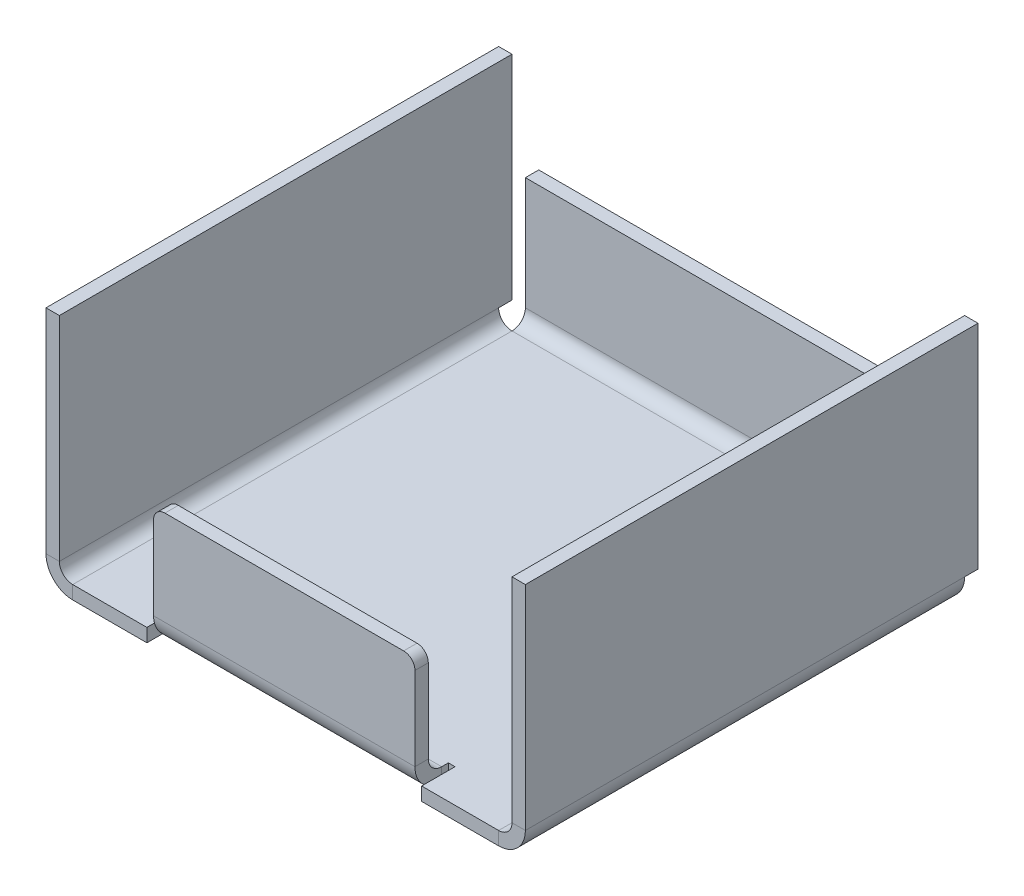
ISO-10303-21;
HEADER;
FILE_DESCRIPTION(('STEP AP214'),'2;1');
FILE_NAME('part.step','',(''),(''),'','','');
FILE_SCHEMA(('AUTOMOTIVE_DESIGN { 1 0 10303 214 1 1 1 1 }'));
ENDSEC;
DATA;
#1=APPLICATION_CONTEXT('core data for automotive mechanical design processes');
#2=APPLICATION_PROTOCOL_DEFINITION('international standard','automotive_design',2000,#1);
#3=PRODUCT_CONTEXT('',#1,'mechanical');
#4=PRODUCT('Part','Part','',(#3));
#5=PRODUCT_RELATED_PRODUCT_CATEGORY('part','',(#4));
#6=PRODUCT_DEFINITION_FORMATION('','',#4);
#7=PRODUCT_DEFINITION_CONTEXT('part definition',#1,'design');
#8=PRODUCT_DEFINITION('design','',#6,#7);
#9=PRODUCT_DEFINITION_SHAPE('','',#8);
#10=(LENGTH_UNIT() NAMED_UNIT(*) SI_UNIT(.MILLI.,.METRE.));
#11=(NAMED_UNIT(*) PLANE_ANGLE_UNIT() SI_UNIT($,.RADIAN.));
#12=(NAMED_UNIT(*) SI_UNIT($,.STERADIAN.) SOLID_ANGLE_UNIT());
#13=UNCERTAINTY_MEASURE_WITH_UNIT(LENGTH_MEASURE(1.E-05),#10,'distance_accuracy_value','');
#14=(GEOMETRIC_REPRESENTATION_CONTEXT(3) GLOBAL_UNCERTAINTY_ASSIGNED_CONTEXT((#13)) GLOBAL_UNIT_ASSIGNED_CONTEXT((#10,
#11,#12)) REPRESENTATION_CONTEXT('',''));
#15=CARTESIAN_POINT('',(0.,0.,0.));
#16=DIRECTION('',(0.,0.,1.));
#17=DIRECTION('',(1.,0.,0.));
#18=AXIS2_PLACEMENT_3D('',#15,#16,#17);
#19=CARTESIAN_POINT('',(-53.8,3.,-47.8));
#20=DIRECTION('',(0.,1.,0.));
#21=DIRECTION('',(-1.,0.,0.));
#22=AXIS2_PLACEMENT_3D('',#19,#20,#21);
#23=PLANE('',#22);
#24=DIRECTION('',(1.,0.,0.));
#25=VECTOR('',#24,1.);
#26=CARTESIAN_POINT('',(-53.8,3.,-47.8));
#27=LINE('',#26,#25);
#28=CARTESIAN_POINT('',(-53.8,3.,-47.8));
#29=VERTEX_POINT('',#28);
#30=CARTESIAN_POINT('',(-50.8,3.,-47.8));
#31=VERTEX_POINT('',#30);
#32=EDGE_CURVE('E13',#29,#31,#27,.T.);
#33=ORIENTED_EDGE('',*,*,#32,.F.);
#34=DIRECTION('',(0.,0.,-1.));
#35=VECTOR('',#34,1.);
#36=CARTESIAN_POINT('',(-53.8,3.,50.8));
#37=LINE('',#36,#35);
#38=CARTESIAN_POINT('',(-53.8,3.,-50.8));
#39=VERTEX_POINT('',#38);
#40=EDGE_CURVE('E502',#29,#39,#37,.T.);
#41=ORIENTED_EDGE('',*,*,#40,.T.);
#42=DIRECTION('',(-1.,0.,0.));
#43=VECTOR('',#42,1.);
#44=CARTESIAN_POINT('',(-50.8,3.,-50.8));
#45=LINE('',#44,#43);
#46=CARTESIAN_POINT('',(-50.8,3.,-50.8));
#47=VERTEX_POINT('',#46);
#48=EDGE_CURVE('E536',#47,#39,#45,.T.);
#49=ORIENTED_EDGE('',*,*,#48,.F.);
#50=DIRECTION('',(0.,0.,-1.));
#51=VECTOR('',#50,1.);
#52=CARTESIAN_POINT('',(-50.8,3.,50.8));
#53=LINE('',#52,#51);
#54=EDGE_CURVE('E510',#31,#47,#53,.T.);
#55=ORIENTED_EDGE('',*,*,#54,.F.);
#56=EDGE_LOOP('',(#33,#41,#49,#55));
#57=FACE_BOUND('',#56,.T.);
#58=ADVANCED_FACE('F65',(#57),#23,.F.);
#59=CARTESIAN_POINT('',(-47.8,3.,50.8));
#60=DIRECTION('',(0.,0.,-1.));
#61=DIRECTION('',(-1.,0.,0.));
#62=AXIS2_PLACEMENT_3D('',#59,#60,#61);
#63=CYLINDRICAL_SURFACE('',#62,3.);
#64=DIRECTION('',(0.,0.,-1.));
#65=VECTOR('',#64,1.);
#66=CARTESIAN_POINT('',(-47.8,0.,50.8));
#67=LINE('',#66,#65);
#68=CARTESIAN_POINT('',(-47.8,0.,50.8));
#69=VERTEX_POINT('',#68);
#70=CARTESIAN_POINT('',(-47.8,0.,-47.8));
#71=VERTEX_POINT('',#70);
#72=EDGE_CURVE('E514',#69,#71,#67,.T.);
#73=ORIENTED_EDGE('',*,*,#72,.T.);
#74=CARTESIAN_POINT('',(-47.8,3.,-47.8));
#75=DIRECTION('',(0.,0.,-1.));
#76=DIRECTION('',(0.,1.,0.));
#77=AXIS2_PLACEMENT_3D('',#74,#75,#76);
#78=CIRCLE('',#77,3.);
#79=EDGE_CURVE('E72',#71,#31,#78,.T.);
#80=ORIENTED_EDGE('',*,*,#79,.T.);
#81=CARTESIAN_POINT('',(-50.8,3.,50.8));
#82=VERTEX_POINT('',#81);
#83=EDGE_CURVE('E511',#82,#31,#53,.T.);
#84=ORIENTED_EDGE('',*,*,#83,.F.);
#85=CARTESIAN_POINT('',(-47.8,3.,50.8));
#86=DIRECTION('',(0.,0.,-1.));
#87=DIRECTION('',(-1.,0.,0.));
#88=AXIS2_PLACEMENT_3D('',#85,#86,#87);
#89=CIRCLE('',#88,3.);
#90=EDGE_CURVE('E455',#82,#69,#89,.F.);
#91=ORIENTED_EDGE('',*,*,#90,.T.);
#92=EDGE_LOOP('',(#73,#80,#84,#91));
#93=FACE_BOUND('',#92,.T.);
#94=ADVANCED_FACE('F570',(#93),#63,.F.);
#95=CARTESIAN_POINT('',(-47.8,3.,-47.8));
#96=DIRECTION('',(0.,0.,-1.));
#97=DIRECTION('',(0.,1.,0.));
#98=AXIS2_PLACEMENT_3D('',#95,#96,#97);
#99=PLANE('',#98);
#100=CARTESIAN_POINT('',(-47.8,3.,-47.8));
#101=DIRECTION('',(0.,0.,-1.));
#102=DIRECTION('',(0.,1.,0.));
#103=AXIS2_PLACEMENT_3D('',#100,#101,#102);
#104=CIRCLE('',#103,6.);
#105=CARTESIAN_POINT('',(-47.8,-3.00000000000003,-47.8));
#106=VERTEX_POINT('',#105);
#107=EDGE_CURVE('E567',#106,#29,#104,.T.);
#108=ORIENTED_EDGE('',*,*,#107,.T.);
#109=ORIENTED_EDGE('',*,*,#32,.T.);
#110=ORIENTED_EDGE('',*,*,#79,.F.);
#111=DIRECTION('',(0.,-1.,0.));
#112=VECTOR('',#111,1.);
#113=CARTESIAN_POINT('',(-47.8,0.,-47.8));
#114=LINE('',#113,#112);
#115=EDGE_CURVE('E324',#71,#106,#114,.T.);
#116=ORIENTED_EDGE('',*,*,#115,.T.);
#117=EDGE_LOOP('',(#108,#109,#110,#116));
#118=FACE_BOUND('',#117,.T.);
#119=ADVANCED_FACE('F667',(#118),#99,.T.);
#120=CARTESIAN_POINT('',(50.8,3.,-47.8));
#121=DIRECTION('',(0.,1.,0.));
#122=DIRECTION('',(0.,0.,1.));
#123=AXIS2_PLACEMENT_3D('',#120,#121,#122);
#124=PLANE('',#123);
#125=DIRECTION('',(1.,0.,0.));
#126=VECTOR('',#125,1.);
#127=CARTESIAN_POINT('',(50.8,3.,-47.8));
#128=LINE('',#127,#126);
#129=CARTESIAN_POINT('',(50.8,3.,-47.8));
#130=VERTEX_POINT('',#129);
#131=CARTESIAN_POINT('',(53.8,3.,-47.8));
#132=VERTEX_POINT('',#131);
#133=EDGE_CURVE('E565',#130,#132,#128,.T.);
#134=ORIENTED_EDGE('',*,*,#133,.F.);
#135=DIRECTION('',(0.,0.,-1.));
#136=VECTOR('',#135,1.);
#137=CARTESIAN_POINT('',(50.8,3.,50.8));
#138=LINE('',#137,#136);
#139=CARTESIAN_POINT('',(50.8,3.,-50.8));
#140=VERTEX_POINT('',#139);
#141=EDGE_CURVE('E520',#130,#140,#138,.T.);
#142=ORIENTED_EDGE('',*,*,#141,.T.);
#143=DIRECTION('',(-1.,0.,0.));
#144=VECTOR('',#143,1.);
#145=CARTESIAN_POINT('',(53.8,3.,-50.8));
#146=LINE('',#145,#144);
#147=CARTESIAN_POINT('',(53.8,3.,-50.8));
#148=VERTEX_POINT('',#147);
#149=EDGE_CURVE('E528',#148,#140,#146,.T.);
#150=ORIENTED_EDGE('',*,*,#149,.F.);
#151=DIRECTION('',(0.,0.,-1.));
#152=VECTOR('',#151,1.);
#153=CARTESIAN_POINT('',(53.8,3.,50.8));
#154=LINE('',#153,#152);
#155=EDGE_CURVE('E477',#132,#148,#154,.T.);
#156=ORIENTED_EDGE('',*,*,#155,.F.);
#157=EDGE_LOOP('',(#134,#142,#150,#156));
#158=FACE_BOUND('',#157,.T.);
#159=ADVANCED_FACE('F672',(#158),#124,.F.);
#160=CARTESIAN_POINT('',(47.8,3.,50.8));
#161=DIRECTION('',(0.,0.,-1.));
#162=DIRECTION('',(-1.,0.,0.));
#163=AXIS2_PLACEMENT_3D('',#160,#161,#162);
#164=CYLINDRICAL_SURFACE('',#163,3.);
#165=CARTESIAN_POINT('',(50.8,3.,50.8));
#166=VERTEX_POINT('',#165);
#167=EDGE_CURVE('E521',#166,#130,#138,.T.);
#168=ORIENTED_EDGE('',*,*,#167,.T.);
#169=CARTESIAN_POINT('',(47.8,3.,-47.8));
#170=DIRECTION('',(0.,0.,-1.));
#171=DIRECTION('',(0.,1.,0.));
#172=AXIS2_PLACEMENT_3D('',#169,#170,#171);
#173=CIRCLE('',#172,3.);
#174=CARTESIAN_POINT('',(47.8,0.,-47.8));
#175=VERTEX_POINT('',#174);
#176=EDGE_CURVE('E561',#130,#175,#173,.T.);
#177=ORIENTED_EDGE('',*,*,#176,.T.);
#178=DIRECTION('',(0.,0.,-1.));
#179=VECTOR('',#178,1.);
#180=CARTESIAN_POINT('',(47.8,0.,50.8));
#181=LINE('',#180,#179);
#182=CARTESIAN_POINT('',(47.8,0.,50.8));
#183=VERTEX_POINT('',#182);
#184=EDGE_CURVE('E517',#183,#175,#181,.T.);
#185=ORIENTED_EDGE('',*,*,#184,.F.);
#186=CARTESIAN_POINT('',(47.8,3.,50.8));
#187=DIRECTION('',(0.,0.,-1.));
#188=DIRECTION('',(-1.,0.,0.));
#189=AXIS2_PLACEMENT_3D('',#186,#187,#188);
#190=CIRCLE('',#189,3.);
#191=EDGE_CURVE('E448',#183,#166,#190,.F.);
#192=ORIENTED_EDGE('',*,*,#191,.T.);
#193=EDGE_LOOP('',(#168,#177,#185,#192));
#194=FACE_BOUND('',#193,.T.);
#195=ADVANCED_FACE('F679',(#194),#164,.F.);
#196=CARTESIAN_POINT('',(-50.8,0.,50.8));
#197=DIRECTION('',(0.,1.,0.));
#198=DIRECTION('',(0.,0.,1.));
#199=AXIS2_PLACEMENT_3D('',#196,#197,#198);
#200=PLANE('',#199);
#201=ORIENTED_EDGE('',*,*,#184,.T.);
#202=DIRECTION('',(-1.,0.,0.));
#203=VECTOR('',#202,1.);
#204=CARTESIAN_POINT('',(-47.8,0.,-47.8));
#205=LINE('',#204,#203);
#206=EDGE_CURVE('E328',#71,#175,#205,.F.);
#207=ORIENTED_EDGE('',*,*,#206,.F.);
#208=ORIENTED_EDGE('',*,*,#72,.F.);
#209=DIRECTION('',(1.,0.,0.));
#210=VECTOR('',#209,1.);
#211=CARTESIAN_POINT('',(-50.8,0.,50.8));
#212=LINE('',#211,#210);
#213=CARTESIAN_POINT('',(-31.1512524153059,0.,50.8));
#214=VERTEX_POINT('',#213);
#215=EDGE_CURVE('E452',#69,#214,#212,.T.);
#216=ORIENTED_EDGE('',*,*,#215,.T.);
#217=DIRECTION('',(0.,0.,1.));
#218=VECTOR('',#217,1.);
#219=CARTESIAN_POINT('',(-31.1512524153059,0.,43.3));
#220=LINE('',#219,#218);
#221=CARTESIAN_POINT('',(-31.1512524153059,0.,43.3));
#222=VERTEX_POINT('',#221);
#223=EDGE_CURVE('E424',#222,#214,#220,.T.);
#224=ORIENTED_EDGE('',*,*,#223,.F.);
#225=DIRECTION('',(-1.,0.,0.));
#226=VECTOR('',#225,1.);
#227=CARTESIAN_POINT('',(-29.6512524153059,0.,43.3));
#228=LINE('',#227,#226);
#229=CARTESIAN_POINT('',(-29.6512524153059,0.,43.3));
#230=VERTEX_POINT('',#229);
#231=EDGE_CURVE('E420',#230,#222,#228,.T.);
#232=ORIENTED_EDGE('',*,*,#231,.F.);
#233=DIRECTION('',(0.,0.,-1.));
#234=VECTOR('',#233,1.);
#235=CARTESIAN_POINT('',(-29.6512524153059,0.,44.8));
#236=LINE('',#235,#234);
#237=CARTESIAN_POINT('',(-29.6512524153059,0.,44.8));
#238=VERTEX_POINT('',#237);
#239=EDGE_CURVE('E417',#238,#230,#236,.T.);
#240=ORIENTED_EDGE('',*,*,#239,.F.);
#241=DIRECTION('',(1.,0.,0.));
#242=VECTOR('',#241,1.);
#243=CARTESIAN_POINT('',(29.0126051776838,0.,44.8));
#244=LINE('',#243,#242);
#245=CARTESIAN_POINT('',(29.0126051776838,0.,44.8));
#246=VERTEX_POINT('',#245);
#247=EDGE_CURVE('E394',#246,#238,#244,.F.);
#248=ORIENTED_EDGE('',*,*,#247,.F.);
#249=DIRECTION('',(0.,0.,1.));
#250=VECTOR('',#249,1.);
#251=CARTESIAN_POINT('',(29.0126051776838,0.,43.3));
#252=LINE('',#251,#250);
#253=CARTESIAN_POINT('',(29.0126051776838,0.,43.3));
#254=VERTEX_POINT('',#253);
#255=EDGE_CURVE('E413',#254,#246,#252,.T.);
#256=ORIENTED_EDGE('',*,*,#255,.F.);
#257=DIRECTION('',(-1.,0.,0.));
#258=VECTOR('',#257,1.);
#259=CARTESIAN_POINT('',(30.5126051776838,0.,43.3));
#260=LINE('',#259,#258);
#261=CARTESIAN_POINT('',(30.5126051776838,0.,43.3));
#262=VERTEX_POINT('',#261);
#263=EDGE_CURVE('E409',#262,#254,#260,.T.);
#264=ORIENTED_EDGE('',*,*,#263,.F.);
#265=DIRECTION('',(0.,0.,-1.));
#266=VECTOR('',#265,1.);
#267=CARTESIAN_POINT('',(30.5126051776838,0.,50.8));
#268=LINE('',#267,#266);
#269=CARTESIAN_POINT('',(30.5126051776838,0.,50.8));
#270=VERTEX_POINT('',#269);
#271=EDGE_CURVE('E404',#270,#262,#268,.T.);
#272=ORIENTED_EDGE('',*,*,#271,.F.);
#273=EDGE_CURVE('E451',#270,#183,#212,.T.);
#274=ORIENTED_EDGE('',*,*,#273,.T.);
#275=EDGE_LOOP('',(#201,#207,#208,#216,#224,#232,#240,#248,#256,#264,#272,#274));
#276=FACE_BOUND('',#275,.T.);
#277=ADVANCED_FACE('F602',(#276),#200,.T.);
#278=CARTESIAN_POINT('',(-50.8,-3.,50.8));
#279=DIRECTION('',(0.,1.,0.));
#280=DIRECTION('',(0.,0.,1.));
#281=AXIS2_PLACEMENT_3D('',#278,#279,#280);
#282=PLANE('',#281);
#283=DIRECTION('',(-1.,0.,0.));
#284=VECTOR('',#283,1.);
#285=CARTESIAN_POINT('',(-47.8,-3.00000000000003,-47.8));
#286=LINE('',#285,#284);
#287=CARTESIAN_POINT('',(47.8,-3.,-47.8));
#288=VERTEX_POINT('',#287);
#289=EDGE_CURVE('E277',#106,#288,#286,.F.);
#290=ORIENTED_EDGE('',*,*,#289,.T.);
#291=DIRECTION('',(0.,0.,-1.));
#292=VECTOR('',#291,1.);
#293=CARTESIAN_POINT('',(47.8,-3.,50.8));
#294=LINE('',#293,#292);
#295=CARTESIAN_POINT('',(47.8,-3.,50.8));
#296=VERTEX_POINT('',#295);
#297=EDGE_CURVE('E497',#296,#288,#294,.T.);
#298=ORIENTED_EDGE('',*,*,#297,.F.);
#299=DIRECTION('',(1.,0.,0.));
#300=VECTOR('',#299,1.);
#301=CARTESIAN_POINT('',(-50.8,-3.,50.8));
#302=LINE('',#301,#300);
#303=CARTESIAN_POINT('',(30.5126051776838,-3.,50.8));
#304=VERTEX_POINT('',#303);
#305=EDGE_CURVE('E470',#304,#296,#302,.T.);
#306=ORIENTED_EDGE('',*,*,#305,.F.);
#307=DIRECTION('',(0.,0.,1.));
#308=VECTOR('',#307,1.);
#309=CARTESIAN_POINT('',(30.5126051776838,-3.,50.8));
#310=LINE('',#309,#308);
#311=CARTESIAN_POINT('',(30.5126051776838,-3.,43.3));
#312=VERTEX_POINT('',#311);
#313=EDGE_CURVE('E558',#312,#304,#310,.T.);
#314=ORIENTED_EDGE('',*,*,#313,.F.);
#315=DIRECTION('',(1.,0.,0.));
#316=VECTOR('',#315,1.);
#317=CARTESIAN_POINT('',(-50.8,-3.,43.3));
#318=LINE('',#317,#316);
#319=CARTESIAN_POINT('',(29.0126051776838,-3.,43.3));
#320=VERTEX_POINT('',#319);
#321=EDGE_CURVE('E555',#320,#312,#318,.T.);
#322=ORIENTED_EDGE('',*,*,#321,.F.);
#323=DIRECTION('',(0.,0.,-1.));
#324=VECTOR('',#323,1.);
#325=CARTESIAN_POINT('',(29.0126051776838,-3.,50.8));
#326=LINE('',#325,#324);
#327=CARTESIAN_POINT('',(29.0126051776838,-3.00000000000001,44.8));
#328=VERTEX_POINT('',#327);
#329=EDGE_CURVE('E552',#328,#320,#326,.T.);
#330=ORIENTED_EDGE('',*,*,#329,.F.);
#331=DIRECTION('',(1.,0.,0.));
#332=VECTOR('',#331,1.);
#333=CARTESIAN_POINT('',(29.0126051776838,-3.00000000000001,44.8));
#334=LINE('',#333,#332);
#335=CARTESIAN_POINT('',(-29.6512524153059,-3.,44.8));
#336=VERTEX_POINT('',#335);
#337=EDGE_CURVE('E382',#328,#336,#334,.F.);
#338=ORIENTED_EDGE('',*,*,#337,.T.);
#339=DIRECTION('',(0.,0.,1.));
#340=VECTOR('',#339,1.);
#341=CARTESIAN_POINT('',(-29.6512524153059,-3.,50.8));
#342=LINE('',#341,#340);
#343=CARTESIAN_POINT('',(-29.6512524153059,-3.,43.3));
#344=VERTEX_POINT('',#343);
#345=EDGE_CURVE('E549',#344,#336,#342,.T.);
#346=ORIENTED_EDGE('',*,*,#345,.F.);
#347=DIRECTION('',(1.,0.,0.));
#348=VECTOR('',#347,1.);
#349=CARTESIAN_POINT('',(-50.8,-3.,43.3));
#350=LINE('',#349,#348);
#351=CARTESIAN_POINT('',(-31.1512524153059,-3.,43.3));
#352=VERTEX_POINT('',#351);
#353=EDGE_CURVE('E546',#352,#344,#350,.T.);
#354=ORIENTED_EDGE('',*,*,#353,.F.);
#355=DIRECTION('',(0.,0.,-1.));
#356=VECTOR('',#355,1.);
#357=CARTESIAN_POINT('',(-31.1512524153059,-3.,50.8));
#358=LINE('',#357,#356);
#359=CARTESIAN_POINT('',(-31.1512524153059,-3.,50.8));
#360=VERTEX_POINT('',#359);
#361=EDGE_CURVE('E543',#360,#352,#358,.T.);
#362=ORIENTED_EDGE('',*,*,#361,.F.);
#363=CARTESIAN_POINT('',(-47.8,-3.,50.8));
#364=VERTEX_POINT('',#363);
#365=EDGE_CURVE('E471',#364,#360,#302,.T.);
#366=ORIENTED_EDGE('',*,*,#365,.F.);
#367=DIRECTION('',(0.,0.,-1.));
#368=VECTOR('',#367,1.);
#369=CARTESIAN_POINT('',(-47.8,-3.,50.8));
#370=LINE('',#369,#368);
#371=EDGE_CURVE('E500',#364,#106,#370,.T.);
#372=ORIENTED_EDGE('',*,*,#371,.T.);
#373=EDGE_LOOP('',(#290,#298,#306,#314,#322,#330,#338,#346,#354,#362,#366,#372));
#374=FACE_BOUND('',#373,.T.);
#375=ADVANCED_FACE('F678',(#374),#282,.F.);
#376=CARTESIAN_POINT('',(-53.8,3.,50.8));
#377=DIRECTION('',(0.,0.,1.));
#378=DIRECTION('',(1.,0.,0.));
#379=AXIS2_PLACEMENT_3D('',#376,#377,#378);
#380=PLANE('',#379);
#381=ORIENTED_EDGE('',*,*,#273,.F.);
#382=DIRECTION('',(0.,-1.,0.));
#383=VECTOR('',#382,1.);
#384=CARTESIAN_POINT('',(30.5126051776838,0.,50.8));
#385=LINE('',#384,#383);
#386=EDGE_CURVE('E408',#270,#304,#385,.T.);
#387=ORIENTED_EDGE('',*,*,#386,.T.);
#388=ORIENTED_EDGE('',*,*,#305,.T.);
#389=DIRECTION('',(0.,1.,0.));
#390=VECTOR('',#389,1.);
#391=CARTESIAN_POINT('',(47.8,-3.,50.8));
#392=LINE('',#391,#390);
#393=EDGE_CURVE('E531',#296,#183,#392,.T.);
#394=ORIENTED_EDGE('',*,*,#393,.T.);
#395=EDGE_LOOP('',(#381,#387,#388,#394));
#396=FACE_BOUND('',#395,.T.);
#397=ADVANCED_FACE('F708',(#396),#380,.T.);
#398=ORIENTED_EDGE('',*,*,#365,.T.);
#399=DIRECTION('',(0.,-1.,0.));
#400=VECTOR('',#399,1.);
#401=CARTESIAN_POINT('',(-31.1512524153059,0.,50.8));
#402=LINE('',#401,#400);
#403=EDGE_CURVE('E427',#214,#360,#402,.T.);
#404=ORIENTED_EDGE('',*,*,#403,.F.);
#405=ORIENTED_EDGE('',*,*,#215,.F.);
#406=DIRECTION('',(0.,-1.,0.));
#407=VECTOR('',#406,1.);
#408=CARTESIAN_POINT('',(-47.8,0.,50.8));
#409=LINE('',#408,#407);
#410=EDGE_CURVE('E541',#69,#364,#409,.T.);
#411=ORIENTED_EDGE('',*,*,#410,.T.);
#412=EDGE_LOOP('',(#398,#404,#405,#411));
#413=FACE_BOUND('',#412,.T.);
#414=ADVANCED_FACE('F603',(#413),#380,.T.);
#415=CARTESIAN_POINT('',(-47.8,0.,50.8));
#416=DIRECTION('',(0.,0.,1.));
#417=DIRECTION('',(1.,0.,0.));
#418=AXIS2_PLACEMENT_3D('',#415,#416,#417);
#419=PLANE('',#418);
#420=ORIENTED_EDGE('',*,*,#410,.F.);
#421=ORIENTED_EDGE('',*,*,#90,.F.);
#422=DIRECTION('',(1.,0.,0.));
#423=VECTOR('',#422,1.);
#424=CARTESIAN_POINT('',(-53.8,3.,50.8));
#425=LINE('',#424,#423);
#426=CARTESIAN_POINT('',(-53.8,3.,50.8));
#427=VERTEX_POINT('',#426);
#428=EDGE_CURVE('E539',#427,#82,#425,.T.);
#429=ORIENTED_EDGE('',*,*,#428,.F.);
#430=CARTESIAN_POINT('',(-47.8,3.,50.8));
#431=DIRECTION('',(0.,0.,1.));
#432=DIRECTION('',(1.,0.,0.));
#433=AXIS2_PLACEMENT_3D('',#430,#431,#432);
#434=CIRCLE('',#433,6.);
#435=EDGE_CURVE('E467',#427,#364,#434,.T.);
#436=ORIENTED_EDGE('',*,*,#435,.T.);
#437=EDGE_LOOP('',(#420,#421,#429,#436));
#438=FACE_BOUND('',#437,.T.);
#439=ADVANCED_FACE('F598',(#438),#419,.T.);
#440=CARTESIAN_POINT('',(-47.8,-3.,-50.8));
#441=DIRECTION('',(0.,0.,-1.));
#442=DIRECTION('',(-1.,0.,0.));
#443=AXIS2_PLACEMENT_3D('',#440,#441,#442);
#444=PLANE('',#443);
#445=DIRECTION('',(0.,-1.,0.));
#446=VECTOR('',#445,1.);
#447=CARTESIAN_POINT('',(-50.8,50.8,-50.8));
#448=LINE('',#447,#446);
#449=CARTESIAN_POINT('',(-50.8,50.8,-50.8));
#450=VERTEX_POINT('',#449);
#451=EDGE_CURVE('E486',#450,#47,#448,.T.);
#452=ORIENTED_EDGE('',*,*,#451,.T.);
#453=ORIENTED_EDGE('',*,*,#48,.T.);
#454=DIRECTION('',(0.,1.,0.));
#455=VECTOR('',#454,1.);
#456=CARTESIAN_POINT('',(-53.8,50.8,-50.8));
#457=LINE('',#456,#455);
#458=CARTESIAN_POINT('',(-53.8,50.8,-50.8));
#459=VERTEX_POINT('',#458);
#460=EDGE_CURVE('E442',#459,#39,#457,.F.);
#461=ORIENTED_EDGE('',*,*,#460,.F.);
#462=DIRECTION('',(1.,0.,0.));
#463=VECTOR('',#462,1.);
#464=CARTESIAN_POINT('',(-53.8,50.8,-50.8));
#465=LINE('',#464,#463);
#466=EDGE_CURVE('E489',#459,#450,#465,.T.);
#467=ORIENTED_EDGE('',*,*,#466,.T.);
#468=EDGE_LOOP('',(#452,#453,#461,#467));
#469=FACE_BOUND('',#468,.T.);
#470=ADVANCED_FACE('F703',(#469),#444,.T.);
#471=CARTESIAN_POINT('',(50.8,3.,50.8));
#472=DIRECTION('',(0.,0.,1.));
#473=DIRECTION('',(1.,0.,0.));
#474=AXIS2_PLACEMENT_3D('',#471,#472,#473);
#475=PLANE('',#474);
#476=DIRECTION('',(1.,0.,0.));
#477=VECTOR('',#476,1.);
#478=CARTESIAN_POINT('',(50.8,3.,50.8));
#479=LINE('',#478,#477);
#480=CARTESIAN_POINT('',(53.8,3.,50.8));
#481=VERTEX_POINT('',#480);
#482=EDGE_CURVE('E534',#166,#481,#479,.T.);
#483=ORIENTED_EDGE('',*,*,#482,.F.);
#484=ORIENTED_EDGE('',*,*,#191,.F.);
#485=ORIENTED_EDGE('',*,*,#393,.F.);
#486=CARTESIAN_POINT('',(47.8,3.,50.8));
#487=DIRECTION('',(0.,0.,1.));
#488=DIRECTION('',(1.,0.,0.));
#489=AXIS2_PLACEMENT_3D('',#486,#487,#488);
#490=CIRCLE('',#489,6.);
#491=EDGE_CURVE('E474',#296,#481,#490,.T.);
#492=ORIENTED_EDGE('',*,*,#491,.T.);
#493=EDGE_LOOP('',(#483,#484,#485,#492));
#494=FACE_BOUND('',#493,.T.);
#495=ADVANCED_FACE('F699',(#494),#475,.T.);
#496=CARTESIAN_POINT('',(47.8,-3.,50.8));
#497=DIRECTION('',(0.,0.,1.));
#498=DIRECTION('',(1.,0.,0.));
#499=AXIS2_PLACEMENT_3D('',#496,#497,#498);
#500=PLANE('',#499);
#501=DIRECTION('',(0.,1.,0.));
#502=VECTOR('',#501,1.);
#503=CARTESIAN_POINT('',(50.8,0.,50.8));
#504=LINE('',#503,#502);
#505=CARTESIAN_POINT('',(50.8,50.8,50.8));
#506=VERTEX_POINT('',#505);
#507=EDGE_CURVE('E445',#166,#506,#504,.T.);
#508=ORIENTED_EDGE('',*,*,#507,.F.);
#509=ORIENTED_EDGE('',*,*,#482,.T.);
#510=DIRECTION('',(0.,1.,0.));
#511=VECTOR('',#510,1.);
#512=CARTESIAN_POINT('',(53.8,0.,50.8));
#513=LINE('',#512,#511);
#514=CARTESIAN_POINT('',(53.8,50.8,50.8));
#515=VERTEX_POINT('',#514);
#516=EDGE_CURVE('E439',#481,#515,#513,.T.);
#517=ORIENTED_EDGE('',*,*,#516,.T.);
#518=DIRECTION('',(1.,0.,0.));
#519=VECTOR('',#518,1.);
#520=CARTESIAN_POINT('',(50.8,50.8,50.8));
#521=LINE('',#520,#519);
#522=EDGE_CURVE('E441',#506,#515,#521,.T.);
#523=ORIENTED_EDGE('',*,*,#522,.F.);
#524=EDGE_LOOP('',(#508,#509,#517,#523));
#525=FACE_BOUND('',#524,.T.);
#526=ADVANCED_FACE('F695',(#525),#500,.T.);
#527=CARTESIAN_POINT('',(53.8,0.,50.8));
#528=DIRECTION('',(-1.,0.,0.));
#529=DIRECTION('',(0.,0.,1.));
#530=AXIS2_PLACEMENT_3D('',#527,#528,#529);
#531=PLANE('',#530);
#532=DIRECTION('',(0.,1.,0.));
#533=VECTOR('',#532,1.);
#534=CARTESIAN_POINT('',(53.8,0.,-50.8));
#535=LINE('',#534,#533);
#536=CARTESIAN_POINT('',(53.8,50.8,-50.8));
#537=VERTEX_POINT('',#536);
#538=EDGE_CURVE('E407',#148,#537,#535,.T.);
#539=ORIENTED_EDGE('',*,*,#538,.T.);
#540=DIRECTION('',(0.,0.,-1.));
#541=VECTOR('',#540,1.);
#542=CARTESIAN_POINT('',(53.8,50.8,50.8));
#543=LINE('',#542,#541);
#544=EDGE_CURVE('E526',#515,#537,#543,.T.);
#545=ORIENTED_EDGE('',*,*,#544,.F.);
#546=ORIENTED_EDGE('',*,*,#516,.F.);
#547=EDGE_CURVE('E494',#481,#132,#154,.T.);
#548=ORIENTED_EDGE('',*,*,#547,.T.);
#549=ORIENTED_EDGE('',*,*,#155,.T.);
#550=EDGE_LOOP('',(#539,#545,#546,#548,#549));
#551=FACE_BOUND('',#550,.T.);
#552=ADVANCED_FACE('F691',(#551),#531,.F.);
#553=CARTESIAN_POINT('',(50.8,50.8,50.8));
#554=DIRECTION('',(0.,1.,0.));
#555=DIRECTION('',(0.,0.,1.));
#556=AXIS2_PLACEMENT_3D('',#553,#554,#555);
#557=PLANE('',#556);
#558=DIRECTION('',(1.,0.,0.));
#559=VECTOR('',#558,1.);
#560=CARTESIAN_POINT('',(50.8,50.8,-50.8));
#561=LINE('',#560,#559);
#562=CARTESIAN_POINT('',(50.8,50.8,-50.8));
#563=VERTEX_POINT('',#562);
#564=EDGE_CURVE('E480',#563,#537,#561,.T.);
#565=ORIENTED_EDGE('',*,*,#564,.F.);
#566=DIRECTION('',(0.,0.,-1.));
#567=VECTOR('',#566,1.);
#568=CARTESIAN_POINT('',(50.8,50.8,50.8));
#569=LINE('',#568,#567);
#570=EDGE_CURVE('E524',#506,#563,#569,.T.);
#571=ORIENTED_EDGE('',*,*,#570,.F.);
#572=ORIENTED_EDGE('',*,*,#522,.T.);
#573=ORIENTED_EDGE('',*,*,#544,.T.);
#574=EDGE_LOOP('',(#565,#571,#572,#573));
#575=FACE_BOUND('',#574,.T.);
#576=ADVANCED_FACE('F687',(#575),#557,.T.);
#577=CARTESIAN_POINT('',(50.8,0.,50.8));
#578=DIRECTION('',(-1.,0.,0.));
#579=DIRECTION('',(0.,0.,1.));
#580=AXIS2_PLACEMENT_3D('',#577,#578,#579);
#581=PLANE('',#580);
#582=DIRECTION('',(0.,1.,0.));
#583=VECTOR('',#582,1.);
#584=CARTESIAN_POINT('',(50.8,0.,-50.8));
#585=LINE('',#584,#583);
#586=EDGE_CURVE('E483',#140,#563,#585,.T.);
#587=ORIENTED_EDGE('',*,*,#586,.F.);
#588=ORIENTED_EDGE('',*,*,#141,.F.);
#589=ORIENTED_EDGE('',*,*,#167,.F.);
#590=ORIENTED_EDGE('',*,*,#507,.T.);
#591=ORIENTED_EDGE('',*,*,#570,.T.);
#592=EDGE_LOOP('',(#587,#588,#589,#590,#591));
#593=FACE_BOUND('',#592,.T.);
#594=ADVANCED_FACE('F683',(#593),#581,.T.);
#595=CARTESIAN_POINT('',(47.8,3.,-47.8));
#596=DIRECTION('',(0.,0.,-1.));
#597=DIRECTION('',(0.,1.,0.));
#598=AXIS2_PLACEMENT_3D('',#595,#596,#597);
#599=PLANE('',#598);
#600=ORIENTED_EDGE('',*,*,#176,.F.);
#601=ORIENTED_EDGE('',*,*,#133,.T.);
#602=CARTESIAN_POINT('',(47.8,3.,-47.8));
#603=DIRECTION('',(0.,0.,-1.));
#604=DIRECTION('',(0.,1.,0.));
#605=AXIS2_PLACEMENT_3D('',#602,#603,#604);
#606=CIRCLE('',#605,6.);
#607=EDGE_CURVE('E563',#132,#288,#606,.T.);
#608=ORIENTED_EDGE('',*,*,#607,.T.);
#609=DIRECTION('',(0.,-1.,0.));
#610=VECTOR('',#609,1.);
#611=CARTESIAN_POINT('',(47.8,0.,-47.8));
#612=LINE('',#611,#610);
#613=EDGE_CURVE('E332',#175,#288,#612,.T.);
#614=ORIENTED_EDGE('',*,*,#613,.F.);
#615=EDGE_LOOP('',(#600,#601,#608,#614));
#616=FACE_BOUND('',#615,.T.);
#617=ADVANCED_FACE('F686',(#616),#599,.T.);
#618=CARTESIAN_POINT('',(-50.8,50.8,50.8));
#619=DIRECTION('',(1.,0.,0.));
#620=DIRECTION('',(0.,0.,-1.));
#621=AXIS2_PLACEMENT_3D('',#618,#619,#620);
#622=PLANE('',#621);
#623=ORIENTED_EDGE('',*,*,#451,.F.);
#624=DIRECTION('',(0.,0.,-1.));
#625=VECTOR('',#624,1.);
#626=CARTESIAN_POINT('',(-50.8,50.8,50.8));
#627=LINE('',#626,#625);
#628=CARTESIAN_POINT('',(-50.8,50.8,50.8));
#629=VERTEX_POINT('',#628);
#630=EDGE_CURVE('E508',#629,#450,#627,.T.);
#631=ORIENTED_EDGE('',*,*,#630,.F.);
#632=DIRECTION('',(0.,-1.,0.));
#633=VECTOR('',#632,1.);
#634=CARTESIAN_POINT('',(-50.8,50.8,50.8));
#635=LINE('',#634,#633);
#636=EDGE_CURVE('E458',#629,#82,#635,.T.);
#637=ORIENTED_EDGE('',*,*,#636,.T.);
#638=ORIENTED_EDGE('',*,*,#83,.T.);
#639=ORIENTED_EDGE('',*,*,#54,.T.);
#640=EDGE_LOOP('',(#623,#631,#637,#638,#639));
#641=FACE_BOUND('',#640,.T.);
#642=ADVANCED_FACE('F577',(#641),#622,.T.);
#643=CARTESIAN_POINT('',(-53.8,50.8,50.8));
#644=DIRECTION('',(0.,1.,0.));
#645=DIRECTION('',(0.,0.,1.));
#646=AXIS2_PLACEMENT_3D('',#643,#644,#645);
#647=PLANE('',#646);
#648=ORIENTED_EDGE('',*,*,#466,.F.);
#649=DIRECTION('',(0.,0.,-1.));
#650=VECTOR('',#649,1.);
#651=CARTESIAN_POINT('',(-53.8,50.8,50.8));
#652=LINE('',#651,#650);
#653=CARTESIAN_POINT('',(-53.8,50.8,50.8));
#654=VERTEX_POINT('',#653);
#655=EDGE_CURVE('E506',#654,#459,#652,.T.);
#656=ORIENTED_EDGE('',*,*,#655,.F.);
#657=DIRECTION('',(1.,0.,0.));
#658=VECTOR('',#657,1.);
#659=CARTESIAN_POINT('',(-53.8,50.8,50.8));
#660=LINE('',#659,#658);
#661=EDGE_CURVE('E461',#654,#629,#660,.T.);
#662=ORIENTED_EDGE('',*,*,#661,.T.);
#663=ORIENTED_EDGE('',*,*,#630,.T.);
#664=EDGE_LOOP('',(#648,#656,#662,#663));
#665=FACE_BOUND('',#664,.T.);
#666=ADVANCED_FACE('F584',(#665),#647,.T.);
#667=CARTESIAN_POINT('',(-53.8,50.8,50.8));
#668=DIRECTION('',(1.,0.,0.));
#669=DIRECTION('',(0.,0.,-1.));
#670=AXIS2_PLACEMENT_3D('',#667,#668,#669);
#671=PLANE('',#670);
#672=ORIENTED_EDGE('',*,*,#460,.T.);
#673=ORIENTED_EDGE('',*,*,#40,.F.);
#674=EDGE_CURVE('E503',#427,#29,#37,.T.);
#675=ORIENTED_EDGE('',*,*,#674,.F.);
#676=DIRECTION('',(0.,1.,0.));
#677=VECTOR('',#676,1.);
#678=CARTESIAN_POINT('',(-53.8,50.8,50.8));
#679=LINE('',#678,#677);
#680=EDGE_CURVE('E464',#654,#427,#679,.F.);
#681=ORIENTED_EDGE('',*,*,#680,.F.);
#682=ORIENTED_EDGE('',*,*,#655,.T.);
#683=EDGE_LOOP('',(#672,#673,#675,#681,#682));
#684=FACE_BOUND('',#683,.T.);
#685=ADVANCED_FACE('F589',(#684),#671,.F.);
#686=CARTESIAN_POINT('',(-47.8,3.,50.8));
#687=DIRECTION('',(0.,0.,-1.));
#688=DIRECTION('',(-1.,0.,0.));
#689=AXIS2_PLACEMENT_3D('',#686,#687,#688);
#690=CYLINDRICAL_SURFACE('',#689,6.);
#691=ORIENTED_EDGE('',*,*,#107,.F.);
#692=ORIENTED_EDGE('',*,*,#371,.F.);
#693=ORIENTED_EDGE('',*,*,#435,.F.);
#694=ORIENTED_EDGE('',*,*,#674,.T.);
#695=EDGE_LOOP('',(#691,#692,#693,#694));
#696=FACE_BOUND('',#695,.T.);
#697=ADVANCED_FACE('F595',(#696),#690,.T.);
#698=CARTESIAN_POINT('',(47.8,3.,50.8));
#699=DIRECTION('',(0.,0.,-1.));
#700=DIRECTION('',(-1.,0.,0.));
#701=AXIS2_PLACEMENT_3D('',#698,#699,#700);
#702=CYLINDRICAL_SURFACE('',#701,6.);
#703=ORIENTED_EDGE('',*,*,#607,.F.);
#704=ORIENTED_EDGE('',*,*,#547,.F.);
#705=ORIENTED_EDGE('',*,*,#491,.F.);
#706=ORIENTED_EDGE('',*,*,#297,.T.);
#707=EDGE_LOOP('',(#703,#704,#705,#706));
#708=FACE_BOUND('',#707,.T.);
#709=ADVANCED_FACE('F744',(#708),#702,.T.);
#710=CARTESIAN_POINT('',(47.8,3.,50.8));
#711=DIRECTION('',(0.,0.,-1.));
#712=DIRECTION('',(-1.,0.,0.));
#713=AXIS2_PLACEMENT_3D('',#710,#711,#712);
#714=PLANE('',#713);
#715=ORIENTED_EDGE('',*,*,#680,.T.);
#716=ORIENTED_EDGE('',*,*,#428,.T.);
#717=ORIENTED_EDGE('',*,*,#636,.F.);
#718=ORIENTED_EDGE('',*,*,#661,.F.);
#719=EDGE_LOOP('',(#715,#716,#717,#718));
#720=FACE_BOUND('',#719,.T.);
#721=ADVANCED_FACE('F581',(#720),#714,.F.);
#722=CARTESIAN_POINT('',(47.8,3.,-50.8));
#723=DIRECTION('',(0.,0.,-1.));
#724=DIRECTION('',(-1.,0.,0.));
#725=AXIS2_PLACEMENT_3D('',#722,#723,#724);
#726=PLANE('',#725);
#727=ORIENTED_EDGE('',*,*,#538,.F.);
#728=ORIENTED_EDGE('',*,*,#149,.T.);
#729=ORIENTED_EDGE('',*,*,#586,.T.);
#730=ORIENTED_EDGE('',*,*,#564,.T.);
#731=EDGE_LOOP('',(#727,#728,#729,#730));
#732=FACE_BOUND('',#731,.T.);
#733=ADVANCED_FACE('F742',(#732),#726,.T.);
#734=CARTESIAN_POINT('',(30.5126051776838,0.,50.8));
#735=DIRECTION('',(-1.,0.,0.));
#736=DIRECTION('',(0.,0.,1.));
#737=AXIS2_PLACEMENT_3D('',#734,#735,#736);
#738=PLANE('',#737);
#739=DIRECTION('',(0.,-1.,0.));
#740=VECTOR('',#739,1.);
#741=CARTESIAN_POINT('',(30.5126051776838,0.,43.3));
#742=LINE('',#741,#740);
#743=EDGE_CURVE('E412',#262,#312,#742,.T.);
#744=ORIENTED_EDGE('',*,*,#743,.T.);
#745=ORIENTED_EDGE('',*,*,#313,.T.);
#746=ORIENTED_EDGE('',*,*,#386,.F.);
#747=ORIENTED_EDGE('',*,*,#271,.T.);
#748=EDGE_LOOP('',(#744,#745,#746,#747));
#749=FACE_BOUND('',#748,.T.);
#750=ADVANCED_FACE('F1044',(#749),#738,.T.);
#751=CARTESIAN_POINT('',(30.5126051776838,0.,43.3));
#752=DIRECTION('',(0.,0.,1.));
#753=DIRECTION('',(0.,-1.,0.));
#754=AXIS2_PLACEMENT_3D('',#751,#752,#753);
#755=PLANE('',#754);
#756=DIRECTION('',(0.,-1.,0.));
#757=VECTOR('',#756,1.);
#758=CARTESIAN_POINT('',(29.0126051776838,0.,43.3));
#759=LINE('',#758,#757);
#760=EDGE_CURVE('E416',#254,#320,#759,.T.);
#761=ORIENTED_EDGE('',*,*,#760,.T.);
#762=ORIENTED_EDGE('',*,*,#321,.T.);
#763=ORIENTED_EDGE('',*,*,#743,.F.);
#764=ORIENTED_EDGE('',*,*,#263,.T.);
#765=EDGE_LOOP('',(#761,#762,#763,#764));
#766=FACE_BOUND('',#765,.T.);
#767=ADVANCED_FACE('F1033',(#766),#755,.T.);
#768=CARTESIAN_POINT('',(29.0126051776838,0.,43.3));
#769=DIRECTION('',(1.,0.,0.));
#770=DIRECTION('',(0.,0.,-1.));
#771=AXIS2_PLACEMENT_3D('',#768,#769,#770);
#772=PLANE('',#771);
#773=DIRECTION('',(0.,-1.,0.));
#774=VECTOR('',#773,1.);
#775=CARTESIAN_POINT('',(29.0126051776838,0.,44.8));
#776=LINE('',#775,#774);
#777=EDGE_CURVE('E388',#246,#328,#776,.T.);
#778=ORIENTED_EDGE('',*,*,#777,.T.);
#779=ORIENTED_EDGE('',*,*,#329,.T.);
#780=ORIENTED_EDGE('',*,*,#760,.F.);
#781=ORIENTED_EDGE('',*,*,#255,.T.);
#782=EDGE_LOOP('',(#778,#779,#780,#781));
#783=FACE_BOUND('',#782,.T.);
#784=ADVANCED_FACE('F1023',(#783),#772,.T.);
#785=CARTESIAN_POINT('',(-29.6512524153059,0.,44.8));
#786=DIRECTION('',(-1.,0.,0.));
#787=DIRECTION('',(0.,0.,1.));
#788=AXIS2_PLACEMENT_3D('',#785,#786,#787);
#789=PLANE('',#788);
#790=DIRECTION('',(0.,-1.,0.));
#791=VECTOR('',#790,1.);
#792=CARTESIAN_POINT('',(-29.6512524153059,0.,43.3));
#793=LINE('',#792,#791);
#794=EDGE_CURVE('E423',#230,#344,#793,.T.);
#795=ORIENTED_EDGE('',*,*,#794,.T.);
#796=ORIENTED_EDGE('',*,*,#345,.T.);
#797=DIRECTION('',(0.,-1.,0.));
#798=VECTOR('',#797,1.);
#799=CARTESIAN_POINT('',(-29.6512524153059,0.,44.8));
#800=LINE('',#799,#798);
#801=EDGE_CURVE('E399',#238,#336,#800,.T.);
#802=ORIENTED_EDGE('',*,*,#801,.F.);
#803=ORIENTED_EDGE('',*,*,#239,.T.);
#804=EDGE_LOOP('',(#795,#796,#802,#803));
#805=FACE_BOUND('',#804,.T.);
#806=ADVANCED_FACE('F612',(#805),#789,.T.);
#807=CARTESIAN_POINT('',(-29.6512524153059,0.,43.3));
#808=DIRECTION('',(0.,0.,1.));
#809=DIRECTION('',(0.,-1.,0.));
#810=AXIS2_PLACEMENT_3D('',#807,#808,#809);
#811=PLANE('',#810);
#812=DIRECTION('',(0.,-1.,0.));
#813=VECTOR('',#812,1.);
#814=CARTESIAN_POINT('',(-31.1512524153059,0.,43.3));
#815=LINE('',#814,#813);
#816=EDGE_CURVE('E402',#222,#352,#815,.T.);
#817=ORIENTED_EDGE('',*,*,#816,.T.);
#818=ORIENTED_EDGE('',*,*,#353,.T.);
#819=ORIENTED_EDGE('',*,*,#794,.F.);
#820=ORIENTED_EDGE('',*,*,#231,.T.);
#821=EDGE_LOOP('',(#817,#818,#819,#820));
#822=FACE_BOUND('',#821,.T.);
#823=ADVANCED_FACE('F610',(#822),#811,.T.);
#824=CARTESIAN_POINT('',(-31.1512524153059,0.,43.3));
#825=DIRECTION('',(1.,0.,0.));
#826=DIRECTION('',(0.,0.,-1.));
#827=AXIS2_PLACEMENT_3D('',#824,#825,#826);
#828=PLANE('',#827);
#829=ORIENTED_EDGE('',*,*,#403,.T.);
#830=ORIENTED_EDGE('',*,*,#361,.T.);
#831=ORIENTED_EDGE('',*,*,#816,.F.);
#832=ORIENTED_EDGE('',*,*,#223,.T.);
#833=EDGE_LOOP('',(#829,#830,#831,#832));
#834=FACE_BOUND('',#833,.T.);
#835=ADVANCED_FACE('F605',(#834),#828,.T.);
#836=CARTESIAN_POINT('',(-29.6512524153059,2.99999999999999,44.8));
#837=DIRECTION('',(-1.,0.,0.));
#838=DIRECTION('',(0.,0.,1.));
#839=AXIS2_PLACEMENT_3D('',#836,#837,#838);
#840=PLANE('',#839);
#841=DIRECTION('',(0.,0.,-1.));
#842=VECTOR('',#841,1.);
#843=CARTESIAN_POINT('',(-29.6512524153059,2.99999999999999,50.8));
#844=LINE('',#843,#842);
#845=CARTESIAN_POINT('',(-29.6512524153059,2.99999999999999,47.8));
#846=VERTEX_POINT('',#845);
#847=CARTESIAN_POINT('',(-29.6512524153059,2.99999999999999,50.8));
#848=VERTEX_POINT('',#847);
#849=EDGE_CURVE('E335',#846,#848,#844,.F.);
#850=ORIENTED_EDGE('',*,*,#849,.F.);
#851=CARTESIAN_POINT('',(-29.6512524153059,2.99999999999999,44.8));
#852=DIRECTION('',(1.,0.,0.));
#853=DIRECTION('',(0.,0.,-1.));
#854=AXIS2_PLACEMENT_3D('',#851,#852,#853);
#855=CIRCLE('',#854,3.);
#856=EDGE_CURVE('E391',#238,#846,#855,.F.);
#857=ORIENTED_EDGE('',*,*,#856,.F.);
#858=ORIENTED_EDGE('',*,*,#801,.T.);
#859=CARTESIAN_POINT('',(-29.6512524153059,2.99999999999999,44.8));
#860=DIRECTION('',(1.,0.,0.));
#861=DIRECTION('',(0.,0.,-1.));
#862=AXIS2_PLACEMENT_3D('',#859,#860,#861);
#863=CIRCLE('',#862,6.);
#864=EDGE_CURVE('E384',#336,#848,#863,.F.);
#865=ORIENTED_EDGE('',*,*,#864,.T.);
#866=EDGE_LOOP('',(#850,#857,#858,#865));
#867=FACE_BOUND('',#866,.T.);
#868=ADVANCED_FACE('F620',(#867),#840,.T.);
#869=CARTESIAN_POINT('',(29.0126051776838,2.99999999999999,44.8));
#870=DIRECTION('',(-1.,0.,0.));
#871=DIRECTION('',(0.,0.,1.));
#872=AXIS2_PLACEMENT_3D('',#869,#870,#871);
#873=PLANE('',#872);
#874=CARTESIAN_POINT('',(29.0126051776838,2.99999999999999,44.8));
#875=DIRECTION('',(1.,0.,0.));
#876=DIRECTION('',(0.,0.,-1.));
#877=AXIS2_PLACEMENT_3D('',#874,#875,#876);
#878=CIRCLE('',#877,3.);
#879=CARTESIAN_POINT('',(29.0126051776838,2.99999999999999,47.8));
#880=VERTEX_POINT('',#879);
#881=EDGE_CURVE('E351',#880,#246,#878,.T.);
#882=ORIENTED_EDGE('',*,*,#881,.F.);
#883=DIRECTION('',(0.,0.,-1.));
#884=VECTOR('',#883,1.);
#885=CARTESIAN_POINT('',(29.0126051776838,2.99999999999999,47.8));
#886=LINE('',#885,#884);
#887=CARTESIAN_POINT('',(29.0126051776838,2.99999999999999,50.8));
#888=VERTEX_POINT('',#887);
#889=EDGE_CURVE('E375',#880,#888,#886,.F.);
#890=ORIENTED_EDGE('',*,*,#889,.T.);
#891=CARTESIAN_POINT('',(29.0126051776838,2.99999999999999,44.8));
#892=DIRECTION('',(1.,0.,0.));
#893=DIRECTION('',(0.,0.,-1.));
#894=AXIS2_PLACEMENT_3D('',#891,#892,#893);
#895=CIRCLE('',#894,6.);
#896=EDGE_CURVE('E385',#888,#328,#895,.T.);
#897=ORIENTED_EDGE('',*,*,#896,.T.);
#898=ORIENTED_EDGE('',*,*,#777,.F.);
#899=EDGE_LOOP('',(#882,#890,#897,#898));
#900=FACE_BOUND('',#899,.T.);
#901=ADVANCED_FACE('F644',(#900),#873,.F.);
#902=CARTESIAN_POINT('',(29.0126051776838,2.99999999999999,44.8));
#903=DIRECTION('',(1.,0.,0.));
#904=DIRECTION('',(0.,0.,1.));
#905=AXIS2_PLACEMENT_3D('',#902,#903,#904);
#906=CYLINDRICAL_SURFACE('',#905,6.);
#907=ORIENTED_EDGE('',*,*,#337,.F.);
#908=ORIENTED_EDGE('',*,*,#896,.F.);
#909=DIRECTION('',(1.,0.,0.));
#910=VECTOR('',#909,1.);
#911=CARTESIAN_POINT('',(-29.6512524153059,2.99999999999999,50.8));
#912=LINE('',#911,#910);
#913=EDGE_CURVE('E373',#888,#848,#912,.F.);
#914=ORIENTED_EDGE('',*,*,#913,.T.);
#915=ORIENTED_EDGE('',*,*,#864,.F.);
#916=EDGE_LOOP('',(#907,#908,#914,#915));
#917=FACE_BOUND('',#916,.T.);
#918=ADVANCED_FACE('F965',(#917),#906,.T.);
#919=CARTESIAN_POINT('',(29.0126051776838,2.99999999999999,44.8));
#920=DIRECTION('',(1.,0.,0.));
#921=DIRECTION('',(0.,0.,1.));
#922=AXIS2_PLACEMENT_3D('',#919,#920,#921);
#923=CYLINDRICAL_SURFACE('',#922,3.);
#924=ORIENTED_EDGE('',*,*,#247,.T.);
#925=ORIENTED_EDGE('',*,*,#856,.T.);
#926=DIRECTION('',(1.,0.,0.));
#927=VECTOR('',#926,1.);
#928=CARTESIAN_POINT('',(-29.6512524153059,2.99999999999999,47.8));
#929=LINE('',#928,#927);
#930=EDGE_CURVE('E378',#846,#880,#929,.T.);
#931=ORIENTED_EDGE('',*,*,#930,.T.);
#932=ORIENTED_EDGE('',*,*,#881,.T.);
#933=EDGE_LOOP('',(#924,#925,#931,#932));
#934=FACE_BOUND('',#933,.T.);
#935=ADVANCED_FACE('F617',(#934),#923,.F.);
#936=CARTESIAN_POINT('',(-29.6512524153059,0.,50.8));
#937=DIRECTION('',(1.,0.,0.));
#938=DIRECTION('',(0.,0.,-1.));
#939=AXIS2_PLACEMENT_3D('',#936,#937,#938);
#940=PLANE('',#939);
#941=ORIENTED_EDGE('',*,*,#849,.T.);
#942=DIRECTION('',(0.,-1.,0.));
#943=VECTOR('',#942,1.);
#944=CARTESIAN_POINT('',(-29.6512524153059,21.7,50.8));
#945=LINE('',#944,#943);
#946=CARTESIAN_POINT('',(-29.6512524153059,21.7,50.8));
#947=VERTEX_POINT('',#946);
#948=EDGE_CURVE('E359',#947,#848,#945,.T.);
#949=ORIENTED_EDGE('',*,*,#948,.F.);
#950=DIRECTION('',(0.,0.,-1.));
#951=VECTOR('',#950,1.);
#952=CARTESIAN_POINT('',(-29.6512524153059,21.7,50.8));
#953=LINE('',#952,#951);
#954=CARTESIAN_POINT('',(-29.6512524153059,21.7,47.8));
#955=VERTEX_POINT('',#954);
#956=EDGE_CURVE('E338',#947,#955,#953,.T.);
#957=ORIENTED_EDGE('',*,*,#956,.T.);
#958=DIRECTION('',(0.,1.,0.));
#959=VECTOR('',#958,1.);
#960=CARTESIAN_POINT('',(-29.6512524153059,0.,47.8));
#961=LINE('',#960,#959);
#962=EDGE_CURVE('E370',#955,#846,#961,.F.);
#963=ORIENTED_EDGE('',*,*,#962,.T.);
#964=EDGE_LOOP('',(#941,#949,#957,#963));
#965=FACE_BOUND('',#964,.T.);
#966=ADVANCED_FACE('F623',(#965),#940,.F.);
#967=CARTESIAN_POINT('',(29.0126051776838,21.7,50.8));
#968=DIRECTION('',(-1.,0.,0.));
#969=DIRECTION('',(0.,0.,1.));
#970=AXIS2_PLACEMENT_3D('',#967,#968,#969);
#971=PLANE('',#970);
#972=ORIENTED_EDGE('',*,*,#889,.F.);
#973=DIRECTION('',(0.,-1.,0.));
#974=VECTOR('',#973,1.);
#975=CARTESIAN_POINT('',(29.0126051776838,21.7,47.8));
#976=LINE('',#975,#974);
#977=CARTESIAN_POINT('',(29.0126051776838,21.7,47.8));
#978=VERTEX_POINT('',#977);
#979=EDGE_CURVE('E368',#880,#978,#976,.F.);
#980=ORIENTED_EDGE('',*,*,#979,.T.);
#981=DIRECTION('',(0.,0.,-1.));
#982=VECTOR('',#981,1.);
#983=CARTESIAN_POINT('',(29.0126051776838,21.7,50.8));
#984=LINE('',#983,#982);
#985=CARTESIAN_POINT('',(29.0126051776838,21.7,50.8));
#986=VERTEX_POINT('',#985);
#987=EDGE_CURVE('E348',#986,#978,#984,.T.);
#988=ORIENTED_EDGE('',*,*,#987,.F.);
#989=DIRECTION('',(0.,1.,0.));
#990=VECTOR('',#989,1.);
#991=CARTESIAN_POINT('',(29.0126051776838,21.7,50.8));
#992=LINE('',#991,#990);
#993=EDGE_CURVE('E357',#888,#986,#992,.T.);
#994=ORIENTED_EDGE('',*,*,#993,.F.);
#995=EDGE_LOOP('',(#972,#980,#988,#994));
#996=FACE_BOUND('',#995,.T.);
#997=ADVANCED_FACE('F646',(#996),#971,.F.);
#998=CARTESIAN_POINT('',(-27.1112524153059,21.7,50.8));
#999=DIRECTION('',(0.,0.,-1.));
#1000=DIRECTION('',(-1.,0.,0.));
#1001=AXIS2_PLACEMENT_3D('',#998,#999,#1000);
#1002=PLANE('',#1001);
#1003=ORIENTED_EDGE('',*,*,#913,.F.);
#1004=ORIENTED_EDGE('',*,*,#993,.T.);
#1005=CARTESIAN_POINT('',(26.4726051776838,21.7,50.8));
#1006=DIRECTION('',(0.,0.,-1.));
#1007=DIRECTION('',(-1.,0.,0.));
#1008=AXIS2_PLACEMENT_3D('',#1005,#1006,#1007);
#1009=CIRCLE('',#1008,2.54);
#1010=CARTESIAN_POINT('',(26.4726051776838,24.24,50.8));
#1011=VERTEX_POINT('',#1010);
#1012=EDGE_CURVE('E355',#986,#1011,#1009,.F.);
#1013=ORIENTED_EDGE('',*,*,#1012,.T.);
#1014=DIRECTION('',(-1.,0.,0.));
#1015=VECTOR('',#1014,1.);
#1016=CARTESIAN_POINT('',(-27.1112524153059,24.24,50.8));
#1017=LINE('',#1016,#1015);
#1018=CARTESIAN_POINT('',(-27.1112524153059,24.24,50.8));
#1019=VERTEX_POINT('',#1018);
#1020=EDGE_CURVE('E353',#1011,#1019,#1017,.T.);
#1021=ORIENTED_EDGE('',*,*,#1020,.T.);
#1022=CARTESIAN_POINT('',(-27.1112524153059,21.7,50.8));
#1023=DIRECTION('',(0.,0.,-1.));
#1024=DIRECTION('',(-1.,0.,0.));
#1025=AXIS2_PLACEMENT_3D('',#1022,#1023,#1024);
#1026=CIRCLE('',#1025,2.54);
#1027=EDGE_CURVE('E342',#1019,#947,#1026,.F.);
#1028=ORIENTED_EDGE('',*,*,#1027,.T.);
#1029=ORIENTED_EDGE('',*,*,#948,.T.);
#1030=EDGE_LOOP('',(#1003,#1004,#1013,#1021,#1028,#1029));
#1031=FACE_BOUND('',#1030,.T.);
#1032=ADVANCED_FACE('F627',(#1031),#1002,.F.);
#1033=CARTESIAN_POINT('',(-27.1112524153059,21.7,47.8));
#1034=DIRECTION('',(0.,0.,-1.));
#1035=DIRECTION('',(-1.,0.,0.));
#1036=AXIS2_PLACEMENT_3D('',#1033,#1034,#1035);
#1037=PLANE('',#1036);
#1038=ORIENTED_EDGE('',*,*,#979,.F.);
#1039=ORIENTED_EDGE('',*,*,#930,.F.);
#1040=ORIENTED_EDGE('',*,*,#962,.F.);
#1041=CARTESIAN_POINT('',(-27.1112524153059,21.7,47.8));
#1042=DIRECTION('',(0.,0.,-1.));
#1043=DIRECTION('',(-1.,0.,0.));
#1044=AXIS2_PLACEMENT_3D('',#1041,#1042,#1043);
#1045=CIRCLE('',#1044,2.54);
#1046=CARTESIAN_POINT('',(-27.1112524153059,24.24,47.8));
#1047=VERTEX_POINT('',#1046);
#1048=EDGE_CURVE('E362',#1047,#955,#1045,.F.);
#1049=ORIENTED_EDGE('',*,*,#1048,.F.);
#1050=DIRECTION('',(1.,0.,0.));
#1051=VECTOR('',#1050,1.);
#1052=CARTESIAN_POINT('',(-27.1112524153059,24.24,47.8));
#1053=LINE('',#1052,#1051);
#1054=CARTESIAN_POINT('',(26.4726051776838,24.24,47.8));
#1055=VERTEX_POINT('',#1054);
#1056=EDGE_CURVE('E364',#1055,#1047,#1053,.F.);
#1057=ORIENTED_EDGE('',*,*,#1056,.F.);
#1058=CARTESIAN_POINT('',(26.4726051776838,21.7,47.8));
#1059=DIRECTION('',(0.,0.,-1.));
#1060=DIRECTION('',(-1.,0.,0.));
#1061=AXIS2_PLACEMENT_3D('',#1058,#1059,#1060);
#1062=CIRCLE('',#1061,2.54);
#1063=EDGE_CURVE('E366',#978,#1055,#1062,.F.);
#1064=ORIENTED_EDGE('',*,*,#1063,.F.);
#1065=EDGE_LOOP('',(#1038,#1039,#1040,#1049,#1057,#1064));
#1066=FACE_BOUND('',#1065,.T.);
#1067=ADVANCED_FACE('F638',(#1066),#1037,.T.);
#1068=CARTESIAN_POINT('',(26.4726051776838,21.7,50.8));
#1069=DIRECTION('',(0.,0.,-1.));
#1070=DIRECTION('',(-1.,0.,0.));
#1071=AXIS2_PLACEMENT_3D('',#1068,#1069,#1070);
#1072=CYLINDRICAL_SURFACE('',#1071,2.54);
#1073=ORIENTED_EDGE('',*,*,#1063,.T.);
#1074=DIRECTION('',(0.,0.,-1.));
#1075=VECTOR('',#1074,1.);
#1076=CARTESIAN_POINT('',(26.4726051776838,24.24,50.8));
#1077=LINE('',#1076,#1075);
#1078=EDGE_CURVE('E345',#1011,#1055,#1077,.T.);
#1079=ORIENTED_EDGE('',*,*,#1078,.F.);
#1080=ORIENTED_EDGE('',*,*,#1012,.F.);
#1081=ORIENTED_EDGE('',*,*,#987,.T.);
#1082=EDGE_LOOP('',(#1073,#1079,#1080,#1081));
#1083=FACE_BOUND('',#1082,.T.);
#1084=ADVANCED_FACE('F651',(#1083),#1072,.T.);
#1085=CARTESIAN_POINT('',(-27.1112524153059,24.24,50.8));
#1086=DIRECTION('',(0.,-1.,0.));
#1087=DIRECTION('',(0.,0.,-1.));
#1088=AXIS2_PLACEMENT_3D('',#1085,#1086,#1087);
#1089=PLANE('',#1088);
#1090=ORIENTED_EDGE('',*,*,#1056,.T.);
#1091=DIRECTION('',(0.,0.,-1.));
#1092=VECTOR('',#1091,1.);
#1093=CARTESIAN_POINT('',(-27.1112524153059,24.24,50.8));
#1094=LINE('',#1093,#1092);
#1095=EDGE_CURVE('E341',#1019,#1047,#1094,.T.);
#1096=ORIENTED_EDGE('',*,*,#1095,.F.);
#1097=ORIENTED_EDGE('',*,*,#1020,.F.);
#1098=ORIENTED_EDGE('',*,*,#1078,.T.);
#1099=EDGE_LOOP('',(#1090,#1096,#1097,#1098));
#1100=FACE_BOUND('',#1099,.T.);
#1101=ADVANCED_FACE('F653',(#1100),#1089,.F.);
#1102=CARTESIAN_POINT('',(-27.1112524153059,21.7,50.8));
#1103=DIRECTION('',(0.,0.,-1.));
#1104=DIRECTION('',(-1.,0.,0.));
#1105=AXIS2_PLACEMENT_3D('',#1102,#1103,#1104);
#1106=CYLINDRICAL_SURFACE('',#1105,2.54);
#1107=ORIENTED_EDGE('',*,*,#1048,.T.);
#1108=ORIENTED_EDGE('',*,*,#956,.F.);
#1109=ORIENTED_EDGE('',*,*,#1027,.F.);
#1110=ORIENTED_EDGE('',*,*,#1095,.T.);
#1111=EDGE_LOOP('',(#1107,#1108,#1109,#1110));
#1112=FACE_BOUND('',#1111,.T.);
#1113=ADVANCED_FACE('F634',(#1112),#1106,.T.);
#1114=CARTESIAN_POINT('',(47.8,2.99999999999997,-47.8));
#1115=DIRECTION('',(1.,0.,0.));
#1116=DIRECTION('',(0.,0.,-1.));
#1117=AXIS2_PLACEMENT_3D('',#1114,#1115,#1116);
#1118=PLANE('',#1117);
#1119=DIRECTION('',(0.,0.,-1.));
#1120=VECTOR('',#1119,1.);
#1121=CARTESIAN_POINT('',(47.8,2.99999999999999,-50.8));
#1122=LINE('',#1121,#1120);
#1123=CARTESIAN_POINT('',(47.8,2.99999999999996,-50.8));
#1124=VERTEX_POINT('',#1123);
#1125=CARTESIAN_POINT('',(47.8,2.99999999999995,-53.8));
#1126=VERTEX_POINT('',#1125);
#1127=EDGE_CURVE('E753',#1124,#1126,#1122,.T.);
#1128=ORIENTED_EDGE('',*,*,#1127,.F.);
#1129=CARTESIAN_POINT('',(47.8,2.99999999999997,-47.8));
#1130=DIRECTION('',(-1.,0.,0.));
#1131=DIRECTION('',(0.,0.,1.));
#1132=AXIS2_PLACEMENT_3D('',#1129,#1130,#1131);
#1133=CIRCLE('',#1132,3.);
#1134=EDGE_CURVE('E280',#175,#1124,#1133,.F.);
#1135=ORIENTED_EDGE('',*,*,#1134,.F.);
#1136=ORIENTED_EDGE('',*,*,#613,.T.);
#1137=CARTESIAN_POINT('',(47.8,2.99999999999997,-47.8));
#1138=DIRECTION('',(-1.,0.,0.));
#1139=DIRECTION('',(0.,0.,1.));
#1140=AXIS2_PLACEMENT_3D('',#1137,#1138,#1139);
#1141=CIRCLE('',#1140,6.);
#1142=EDGE_CURVE('E323',#288,#1126,#1141,.F.);
#1143=ORIENTED_EDGE('',*,*,#1142,.T.);
#1144=EDGE_LOOP('',(#1128,#1135,#1136,#1143));
#1145=FACE_BOUND('',#1144,.T.);
#1146=ADVANCED_FACE('F660',(#1145),#1118,.T.);
#1147=CARTESIAN_POINT('',(-47.8,2.99999999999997,-47.8));
#1148=DIRECTION('',(1.,0.,0.));
#1149=DIRECTION('',(0.,0.,-1.));
#1150=AXIS2_PLACEMENT_3D('',#1147,#1148,#1149);
#1151=PLANE('',#1150);
#1152=CARTESIAN_POINT('',(-47.8,2.99999999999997,-47.8));
#1153=DIRECTION('',(-1.,0.,0.));
#1154=DIRECTION('',(0.,0.,1.));
#1155=AXIS2_PLACEMENT_3D('',#1152,#1153,#1154);
#1156=CIRCLE('',#1155,3.);
#1157=CARTESIAN_POINT('',(-47.8,2.99999999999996,-50.8));
#1158=VERTEX_POINT('',#1157);
#1159=EDGE_CURVE('E287',#1158,#71,#1156,.T.);
#1160=ORIENTED_EDGE('',*,*,#1159,.F.);
#1161=DIRECTION('',(0.,0.,-1.));
#1162=VECTOR('',#1161,1.);
#1163=CARTESIAN_POINT('',(-47.8,2.99999999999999,-50.8));
#1164=LINE('',#1163,#1162);
#1165=CARTESIAN_POINT('',(-47.8,3.00000000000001,-53.8));
#1166=VERTEX_POINT('',#1165);
#1167=EDGE_CURVE('E284',#1158,#1166,#1164,.T.);
#1168=ORIENTED_EDGE('',*,*,#1167,.T.);
#1169=CARTESIAN_POINT('',(-47.8,2.99999999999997,-47.8));
#1170=DIRECTION('',(-1.,0.,0.));
#1171=DIRECTION('',(0.,0.,1.));
#1172=AXIS2_PLACEMENT_3D('',#1169,#1170,#1171);
#1173=CIRCLE('',#1172,6.);
#1174=EDGE_CURVE('E269',#1166,#106,#1173,.T.);
#1175=ORIENTED_EDGE('',*,*,#1174,.T.);
#1176=ORIENTED_EDGE('',*,*,#115,.F.);
#1177=EDGE_LOOP('',(#1160,#1168,#1175,#1176));
#1178=FACE_BOUND('',#1177,.T.);
#1179=ADVANCED_FACE('F285',(#1178),#1151,.F.);
#1180=CARTESIAN_POINT('',(-47.8,2.99999999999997,-47.8));
#1181=DIRECTION('',(-1.,0.,0.));
#1182=DIRECTION('',(0.,0.,-1.));
#1183=AXIS2_PLACEMENT_3D('',#1180,#1181,#1182);
#1184=CYLINDRICAL_SURFACE('',#1183,6.);
#1185=ORIENTED_EDGE('',*,*,#289,.F.);
#1186=ORIENTED_EDGE('',*,*,#1174,.F.);
#1187=DIRECTION('',(1.,0.,0.));
#1188=VECTOR('',#1187,1.);
#1189=CARTESIAN_POINT('',(-47.8,3.00000000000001,-53.8));
#1190=LINE('',#1189,#1188);
#1191=EDGE_CURVE('E274',#1166,#1126,#1190,.T.);
#1192=ORIENTED_EDGE('',*,*,#1191,.T.);
#1193=ORIENTED_EDGE('',*,*,#1142,.F.);
#1194=EDGE_LOOP('',(#1185,#1186,#1192,#1193));
#1195=FACE_BOUND('',#1194,.T.);
#1196=ADVANCED_FACE('F271',(#1195),#1184,.T.);
#1197=CARTESIAN_POINT('',(-47.8,2.99999999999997,-47.8));
#1198=DIRECTION('',(-1.,0.,0.));
#1199=DIRECTION('',(0.,0.,-1.));
#1200=AXIS2_PLACEMENT_3D('',#1197,#1198,#1199);
#1201=CYLINDRICAL_SURFACE('',#1200,3.);
#1202=ORIENTED_EDGE('',*,*,#206,.T.);
#1203=ORIENTED_EDGE('',*,*,#1134,.T.);
#1204=DIRECTION('',(-1.,0.,0.));
#1205=VECTOR('',#1204,1.);
#1206=CARTESIAN_POINT('',(47.8,2.99999999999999,-50.8));
#1207=LINE('',#1206,#1205);
#1208=EDGE_CURVE('E291',#1124,#1158,#1207,.T.);
#1209=ORIENTED_EDGE('',*,*,#1208,.T.);
#1210=ORIENTED_EDGE('',*,*,#1159,.T.);
#1211=EDGE_LOOP('',(#1202,#1203,#1209,#1210));
#1212=FACE_BOUND('',#1211,.T.);
#1213=ADVANCED_FACE('F748',(#1212),#1201,.F.);
#1214=CARTESIAN_POINT('',(-47.8,28.304,-53.8000000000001));
#1215=DIRECTION('',(1.,0.,0.));
#1216=DIRECTION('',(0.,0.,-1.));
#1217=AXIS2_PLACEMENT_3D('',#1214,#1215,#1216);
#1218=PLANE('',#1217);
#1219=ORIENTED_EDGE('',*,*,#1167,.F.);
#1220=DIRECTION('',(0.,1.,0.));
#1221=VECTOR('',#1220,1.);
#1222=CARTESIAN_POINT('',(-47.8,28.304,-50.8000000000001));
#1223=LINE('',#1222,#1221);
#1224=CARTESIAN_POINT('',(-47.8,28.304,-50.8000000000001));
#1225=VERTEX_POINT('',#1224);
#1226=EDGE_CURVE('E300',#1158,#1225,#1223,.T.);
#1227=ORIENTED_EDGE('',*,*,#1226,.T.);
#1228=DIRECTION('',(0.,0.,1.));
#1229=VECTOR('',#1228,1.);
#1230=CARTESIAN_POINT('',(-47.8,28.304,-53.8000000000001));
#1231=LINE('',#1230,#1229);
#1232=CARTESIAN_POINT('',(-47.8,28.304,-53.8000000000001));
#1233=VERTEX_POINT('',#1232);
#1234=EDGE_CURVE('E305',#1233,#1225,#1231,.T.);
#1235=ORIENTED_EDGE('',*,*,#1234,.F.);
#1236=DIRECTION('',(0.,1.,0.));
#1237=VECTOR('',#1236,1.);
#1238=CARTESIAN_POINT('',(-47.8,28.304,-53.8000000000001));
#1239=LINE('',#1238,#1237);
#1240=EDGE_CURVE('E296',#1166,#1233,#1239,.T.);
#1241=ORIENTED_EDGE('',*,*,#1240,.F.);
#1242=EDGE_LOOP('',(#1219,#1227,#1235,#1241));
#1243=FACE_BOUND('',#1242,.T.);
#1244=ADVANCED_FACE('F303',(#1243),#1218,.F.);
#1245=CARTESIAN_POINT('',(47.8,0.,-53.8));
#1246=DIRECTION('',(-1.,0.,0.));
#1247=DIRECTION('',(0.,0.,1.));
#1248=AXIS2_PLACEMENT_3D('',#1245,#1246,#1247);
#1249=PLANE('',#1248);
#1250=ORIENTED_EDGE('',*,*,#1127,.T.);
#1251=DIRECTION('',(0.,-1.,0.));
#1252=VECTOR('',#1251,1.);
#1253=CARTESIAN_POINT('',(47.8,0.,-53.8));
#1254=LINE('',#1253,#1252);
#1255=CARTESIAN_POINT('',(47.8,28.304,-53.8000000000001));
#1256=VERTEX_POINT('',#1255);
#1257=EDGE_CURVE('E299',#1256,#1126,#1254,.T.);
#1258=ORIENTED_EDGE('',*,*,#1257,.F.);
#1259=DIRECTION('',(0.,0.,1.));
#1260=VECTOR('',#1259,1.);
#1261=CARTESIAN_POINT('',(47.8,28.304,-53.8000000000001));
#1262=LINE('',#1261,#1260);
#1263=CARTESIAN_POINT('',(47.8,28.304,-50.8000000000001));
#1264=VERTEX_POINT('',#1263);
#1265=EDGE_CURVE('E316',#1256,#1264,#1262,.T.);
#1266=ORIENTED_EDGE('',*,*,#1265,.T.);
#1267=DIRECTION('',(0.,-1.,0.));
#1268=VECTOR('',#1267,1.);
#1269=CARTESIAN_POINT('',(47.8,0.,-50.8));
#1270=LINE('',#1269,#1268);
#1271=EDGE_CURVE('E307',#1264,#1124,#1270,.T.);
#1272=ORIENTED_EDGE('',*,*,#1271,.T.);
#1273=EDGE_LOOP('',(#1250,#1258,#1266,#1272));
#1274=FACE_BOUND('',#1273,.T.);
#1275=ADVANCED_FACE('F757',(#1274),#1249,.F.);
#1276=CARTESIAN_POINT('',(-47.8,0.,-53.8));
#1277=DIRECTION('',(0.,0.,1.));
#1278=DIRECTION('',(0.,-1.,0.));
#1279=AXIS2_PLACEMENT_3D('',#1276,#1277,#1278);
#1280=PLANE('',#1279);
#1281=ORIENTED_EDGE('',*,*,#1191,.F.);
#1282=ORIENTED_EDGE('',*,*,#1240,.T.);
#1283=DIRECTION('',(1.,0.,0.));
#1284=VECTOR('',#1283,1.);
#1285=CARTESIAN_POINT('',(47.8,28.304,-53.8000000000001));
#1286=LINE('',#1285,#1284);
#1287=EDGE_CURVE('E306',#1233,#1256,#1286,.T.);
#1288=ORIENTED_EDGE('',*,*,#1287,.T.);
#1289=ORIENTED_EDGE('',*,*,#1257,.T.);
#1290=EDGE_LOOP('',(#1281,#1282,#1288,#1289));
#1291=FACE_BOUND('',#1290,.T.);
#1292=ADVANCED_FACE('F295',(#1291),#1280,.F.);
#1293=CARTESIAN_POINT('',(-47.8,0.,-50.8));
#1294=DIRECTION('',(0.,0.,1.));
#1295=DIRECTION('',(0.,-1.,0.));
#1296=AXIS2_PLACEMENT_3D('',#1293,#1294,#1295);
#1297=PLANE('',#1296);
#1298=ORIENTED_EDGE('',*,*,#1226,.F.);
#1299=ORIENTED_EDGE('',*,*,#1208,.F.);
#1300=ORIENTED_EDGE('',*,*,#1271,.F.);
#1301=DIRECTION('',(1.,0.,0.));
#1302=VECTOR('',#1301,1.);
#1303=CARTESIAN_POINT('',(47.8,28.304,-50.8000000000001));
#1304=LINE('',#1303,#1302);
#1305=EDGE_CURVE('E311',#1225,#1264,#1304,.T.);
#1306=ORIENTED_EDGE('',*,*,#1305,.F.);
#1307=EDGE_LOOP('',(#1298,#1299,#1300,#1306));
#1308=FACE_BOUND('',#1307,.T.);
#1309=ADVANCED_FACE('F777',(#1308),#1297,.T.);
#1310=CARTESIAN_POINT('',(47.8,28.304,-53.8000000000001));
#1311=DIRECTION('',(0.,-1.,0.));
#1312=DIRECTION('',(0.,0.,-1.));
#1313=AXIS2_PLACEMENT_3D('',#1310,#1311,#1312);
#1314=PLANE('',#1313);
#1315=ORIENTED_EDGE('',*,*,#1305,.T.);
#1316=ORIENTED_EDGE('',*,*,#1265,.F.);
#1317=ORIENTED_EDGE('',*,*,#1287,.F.);
#1318=ORIENTED_EDGE('',*,*,#1234,.T.);
#1319=EDGE_LOOP('',(#1315,#1316,#1317,#1318));
#1320=FACE_BOUND('',#1319,.T.);
#1321=ADVANCED_FACE('F774',(#1320),#1314,.F.);
#1322=CLOSED_SHELL('',(#58,#94,#119,#159,#195,#277,#375,#397,#414,#439,#470,#495,#526,#552,#576,
#594,#617,#642,#666,#685,#697,#709,#721,#733,#750,#767,#784,#806,#823,#835,#868,#901,#918,#935,
#966,#997,#1032,#1067,#1084,#1101,#1113,#1146,#1179,#1196,#1213,#1244,#1275,#1292,#1309,#1321));
#1323=MANIFOLD_SOLID_BREP('B2',#1322);
#1324=ADVANCED_BREP_SHAPE_REPRESENTATION('',(#18,#1323),#14);
#1325=SHAPE_DEFINITION_REPRESENTATION(#9,#1324);
ENDSEC;
END-ISO-10303-21;
